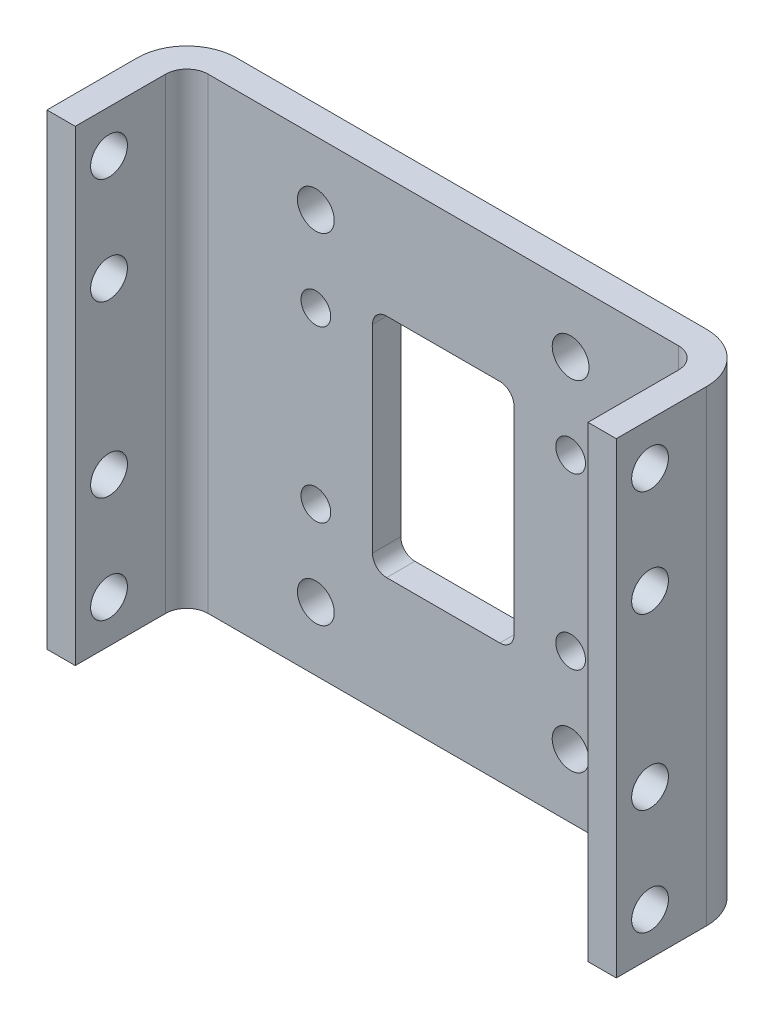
ISO-10303-21;
HEADER;
FILE_DESCRIPTION(('STEP AP214'),'2;1');
FILE_NAME('part.step','',(''),(''),'','','');
FILE_SCHEMA(('AUTOMOTIVE_DESIGN { 1 0 10303 214 1 1 1 1 }'));
ENDSEC;
DATA;
#1=APPLICATION_CONTEXT('core data for automotive mechanical design processes');
#2=APPLICATION_PROTOCOL_DEFINITION('international standard','automotive_design',2000,#1);
#3=PRODUCT_CONTEXT('',#1,'mechanical');
#4=PRODUCT('Part','Part','',(#3));
#5=PRODUCT_RELATED_PRODUCT_CATEGORY('part','',(#4));
#6=PRODUCT_DEFINITION_FORMATION('','',#4);
#7=PRODUCT_DEFINITION_CONTEXT('part definition',#1,'design');
#8=PRODUCT_DEFINITION('design','',#6,#7);
#9=PRODUCT_DEFINITION_SHAPE('','',#8);
#10=(LENGTH_UNIT() NAMED_UNIT(*) SI_UNIT(.MILLI.,.METRE.));
#11=(NAMED_UNIT(*) PLANE_ANGLE_UNIT() SI_UNIT($,.RADIAN.));
#12=(NAMED_UNIT(*) SI_UNIT($,.STERADIAN.) SOLID_ANGLE_UNIT());
#13=UNCERTAINTY_MEASURE_WITH_UNIT(LENGTH_MEASURE(1.E-05),#10,'distance_accuracy_value','');
#14=(GEOMETRIC_REPRESENTATION_CONTEXT(3) GLOBAL_UNCERTAINTY_ASSIGNED_CONTEXT((#13)) GLOBAL_UNIT_ASSIGNED_CONTEXT((#10,
#11,#12)) REPRESENTATION_CONTEXT('',''));
#15=CARTESIAN_POINT('',(0.,0.,0.));
#16=DIRECTION('',(0.,0.,1.));
#17=DIRECTION('',(1.,0.,0.));
#18=AXIS2_PLACEMENT_3D('',#15,#16,#17);
#19=CARTESIAN_POINT('',(-8.,14.,-10.));
#20=DIRECTION('',(0.,0.,-1.));
#21=DIRECTION('',(-1.,0.,0.));
#22=AXIS2_PLACEMENT_3D('',#19,#20,#21);
#23=CYLINDRICAL_SURFACE('',#22,2.);
#24=CARTESIAN_POINT('',(-8.,14.,-4.));
#25=DIRECTION('',(0.,0.,1.));
#26=DIRECTION('',(1.,0.,0.));
#27=AXIS2_PLACEMENT_3D('',#24,#25,#26);
#28=CIRCLE('',#27,2.);
#29=CARTESIAN_POINT('',(-8.,16.,-4.));
#30=VERTEX_POINT('',#29);
#31=CARTESIAN_POINT('',(-10.,14.,-4.));
#32=VERTEX_POINT('',#31);
#33=EDGE_CURVE('E357',#30,#32,#28,.T.);
#34=ORIENTED_EDGE('',*,*,#33,.F.);
#35=DIRECTION('',(0.,0.,-1.));
#36=VECTOR('',#35,1.);
#37=CARTESIAN_POINT('',(-8.,16.,-4.));
#38=LINE('',#37,#36);
#39=CARTESIAN_POINT('',(-8.,16.,0.));
#40=VERTEX_POINT('',#39);
#41=EDGE_CURVE('E11',#40,#30,#38,.T.);
#42=ORIENTED_EDGE('',*,*,#41,.F.);
#43=CARTESIAN_POINT('',(-8.,14.,0.));
#44=DIRECTION('',(0.,0.,-1.));
#45=DIRECTION('',(1.,0.,0.));
#46=AXIS2_PLACEMENT_3D('',#43,#44,#45);
#47=CIRCLE('',#46,2.);
#48=CARTESIAN_POINT('',(-10.,14.,0.));
#49=VERTEX_POINT('',#48);
#50=EDGE_CURVE('E334',#49,#40,#47,.T.);
#51=ORIENTED_EDGE('',*,*,#50,.F.);
#52=DIRECTION('',(0.,0.,1.));
#53=VECTOR('',#52,1.);
#54=CARTESIAN_POINT('',(-10.,14.,0.));
#55=LINE('',#54,#53);
#56=EDGE_CURVE('E493',#32,#49,#55,.T.);
#57=ORIENTED_EDGE('',*,*,#56,.F.);
#58=EDGE_LOOP('',(#34,#42,#51,#57));
#59=FACE_BOUND('',#58,.T.);
#60=ADVANCED_FACE('F17',(#59),#23,.F.);
#61=CARTESIAN_POINT('',(8.,-14.,-10.));
#62=DIRECTION('',(0.,0.,-1.));
#63=DIRECTION('',(-1.,0.,0.));
#64=AXIS2_PLACEMENT_3D('',#61,#62,#63);
#65=CYLINDRICAL_SURFACE('',#64,2.);
#66=CARTESIAN_POINT('',(8.,-14.,-4.));
#67=DIRECTION('',(0.,0.,1.));
#68=DIRECTION('',(1.,0.,0.));
#69=AXIS2_PLACEMENT_3D('',#66,#67,#68);
#70=CIRCLE('',#69,2.);
#71=CARTESIAN_POINT('',(8.,-16.,-4.));
#72=VERTEX_POINT('',#71);
#73=CARTESIAN_POINT('',(10.,-14.,-4.));
#74=VERTEX_POINT('',#73);
#75=EDGE_CURVE('E288',#72,#74,#70,.T.);
#76=ORIENTED_EDGE('',*,*,#75,.F.);
#77=DIRECTION('',(0.,0.,-1.));
#78=VECTOR('',#77,1.);
#79=CARTESIAN_POINT('',(8.,-16.,-4.));
#80=LINE('',#79,#78);
#81=CARTESIAN_POINT('',(8.,-16.,0.));
#82=VERTEX_POINT('',#81);
#83=EDGE_CURVE('E431',#82,#72,#80,.T.);
#84=ORIENTED_EDGE('',*,*,#83,.F.);
#85=CARTESIAN_POINT('',(8.,-14.,0.));
#86=DIRECTION('',(0.,0.,-1.));
#87=DIRECTION('',(1.,0.,0.));
#88=AXIS2_PLACEMENT_3D('',#85,#86,#87);
#89=CIRCLE('',#88,2.);
#90=CARTESIAN_POINT('',(10.,-14.,0.));
#91=VERTEX_POINT('',#90);
#92=EDGE_CURVE('E397',#91,#82,#89,.T.);
#93=ORIENTED_EDGE('',*,*,#92,.F.);
#94=DIRECTION('',(0.,0.,1.));
#95=VECTOR('',#94,1.);
#96=CARTESIAN_POINT('',(10.,-14.,0.));
#97=LINE('',#96,#95);
#98=EDGE_CURVE('E486',#74,#91,#97,.T.);
#99=ORIENTED_EDGE('',*,*,#98,.F.);
#100=EDGE_LOOP('',(#76,#84,#93,#99));
#101=FACE_BOUND('',#100,.T.);
#102=ADVANCED_FACE('F526',(#101),#65,.F.);
#103=CARTESIAN_POINT('',(8.,14.,-10.));
#104=DIRECTION('',(0.,0.,-1.));
#105=DIRECTION('',(-1.,0.,0.));
#106=AXIS2_PLACEMENT_3D('',#103,#104,#105);
#107=CYLINDRICAL_SURFACE('',#106,2.);
#108=CARTESIAN_POINT('',(8.,14.,-4.));
#109=DIRECTION('',(0.,0.,1.));
#110=DIRECTION('',(1.,0.,0.));
#111=AXIS2_PLACEMENT_3D('',#108,#109,#110);
#112=CIRCLE('',#111,2.);
#113=CARTESIAN_POINT('',(10.,14.,-4.));
#114=VERTEX_POINT('',#113);
#115=CARTESIAN_POINT('',(8.,16.,-4.));
#116=VERTEX_POINT('',#115);
#117=EDGE_CURVE('E358',#114,#116,#112,.T.);
#118=ORIENTED_EDGE('',*,*,#117,.F.);
#119=DIRECTION('',(0.,0.,-1.));
#120=VECTOR('',#119,1.);
#121=CARTESIAN_POINT('',(10.,14.,-4.));
#122=LINE('',#121,#120);
#123=CARTESIAN_POINT('',(10.,14.,0.));
#124=VERTEX_POINT('',#123);
#125=EDGE_CURVE('E483',#124,#114,#122,.T.);
#126=ORIENTED_EDGE('',*,*,#125,.F.);
#127=CARTESIAN_POINT('',(8.,14.,0.));
#128=DIRECTION('',(0.,0.,-1.));
#129=DIRECTION('',(1.,0.,0.));
#130=AXIS2_PLACEMENT_3D('',#127,#128,#129);
#131=CIRCLE('',#130,2.);
#132=CARTESIAN_POINT('',(8.,16.,0.));
#133=VERTEX_POINT('',#132);
#134=EDGE_CURVE('E329',#133,#124,#131,.T.);
#135=ORIENTED_EDGE('',*,*,#134,.F.);
#136=DIRECTION('',(0.,0.,1.));
#137=VECTOR('',#136,1.);
#138=CARTESIAN_POINT('',(8.,16.,0.));
#139=LINE('',#138,#137);
#140=EDGE_CURVE('E26',#116,#133,#139,.T.);
#141=ORIENTED_EDGE('',*,*,#140,.F.);
#142=EDGE_LOOP('',(#118,#126,#135,#141));
#143=FACE_BOUND('',#142,.T.);
#144=ADVANCED_FACE('F19',(#143),#107,.F.);
#145=CARTESIAN_POINT('',(-8.,-14.,-10.));
#146=DIRECTION('',(0.,0.,-1.));
#147=DIRECTION('',(-1.,0.,0.));
#148=AXIS2_PLACEMENT_3D('',#145,#146,#147);
#149=CYLINDRICAL_SURFACE('',#148,2.);
#150=CARTESIAN_POINT('',(-8.,-14.,-4.));
#151=DIRECTION('',(0.,0.,1.));
#152=DIRECTION('',(1.,0.,0.));
#153=AXIS2_PLACEMENT_3D('',#150,#151,#152);
#154=CIRCLE('',#153,2.);
#155=CARTESIAN_POINT('',(-10.,-14.,-4.));
#156=VERTEX_POINT('',#155);
#157=CARTESIAN_POINT('',(-8.,-16.,-4.));
#158=VERTEX_POINT('',#157);
#159=EDGE_CURVE('E263',#156,#158,#154,.T.);
#160=ORIENTED_EDGE('',*,*,#159,.F.);
#161=DIRECTION('',(0.,0.,-1.));
#162=VECTOR('',#161,1.);
#163=CARTESIAN_POINT('',(-10.,-14.,-4.));
#164=LINE('',#163,#162);
#165=CARTESIAN_POINT('',(-10.,-14.,0.));
#166=VERTEX_POINT('',#165);
#167=EDGE_CURVE('E434',#166,#156,#164,.T.);
#168=ORIENTED_EDGE('',*,*,#167,.F.);
#169=CARTESIAN_POINT('',(-8.,-14.,0.));
#170=DIRECTION('',(0.,0.,-1.));
#171=DIRECTION('',(1.,0.,0.));
#172=AXIS2_PLACEMENT_3D('',#169,#170,#171);
#173=CIRCLE('',#172,2.);
#174=CARTESIAN_POINT('',(-8.,-16.,0.));
#175=VERTEX_POINT('',#174);
#176=EDGE_CURVE('E410',#175,#166,#173,.T.);
#177=ORIENTED_EDGE('',*,*,#176,.F.);
#178=DIRECTION('',(0.,0.,1.));
#179=VECTOR('',#178,1.);
#180=CARTESIAN_POINT('',(-8.,-16.,0.));
#181=LINE('',#180,#179);
#182=EDGE_CURVE('E435',#158,#175,#181,.T.);
#183=ORIENTED_EDGE('',*,*,#182,.F.);
#184=EDGE_LOOP('',(#160,#168,#177,#183));
#185=FACE_BOUND('',#184,.T.);
#186=ADVANCED_FACE('F533',(#185),#149,.F.);
#187=CARTESIAN_POINT('',(-10.,16.,-10.));
#188=DIRECTION('',(0.,1.,0.));
#189=DIRECTION('',(1.,0.,0.));
#190=AXIS2_PLACEMENT_3D('',#187,#188,#189);
#191=PLANE('',#190);
#192=DIRECTION('',(-1.,0.,0.));
#193=VECTOR('',#192,1.);
#194=CARTESIAN_POINT('',(0.,16.,-4.));
#195=LINE('',#194,#193);
#196=EDGE_CURVE('E353',#116,#30,#195,.T.);
#197=ORIENTED_EDGE('',*,*,#196,.F.);
#198=ORIENTED_EDGE('',*,*,#140,.T.);
#199=DIRECTION('',(-1.,0.,0.));
#200=VECTOR('',#199,1.);
#201=CARTESIAN_POINT('',(-10.,16.,0.));
#202=LINE('',#201,#200);
#203=EDGE_CURVE('E333',#133,#40,#202,.T.);
#204=ORIENTED_EDGE('',*,*,#203,.T.);
#205=ORIENTED_EDGE('',*,*,#41,.T.);
#206=EDGE_LOOP('',(#197,#198,#204,#205));
#207=FACE_BOUND('',#206,.T.);
#208=ADVANCED_FACE('F501',(#207),#191,.F.);
#209=CARTESIAN_POINT('',(-10.,16.,-10.));
#210=DIRECTION('',(-1.,0.,0.));
#211=DIRECTION('',(0.,0.,1.));
#212=AXIS2_PLACEMENT_3D('',#209,#210,#211);
#213=PLANE('',#212);
#214=DIRECTION('',(0.,-1.,0.));
#215=VECTOR('',#214,1.);
#216=CARTESIAN_POINT('',(-10.,16.,0.));
#217=LINE('',#216,#215);
#218=EDGE_CURVE('E338',#49,#166,#217,.T.);
#219=ORIENTED_EDGE('',*,*,#218,.T.);
#220=ORIENTED_EDGE('',*,*,#167,.T.);
#221=DIRECTION('',(0.,-1.,0.));
#222=VECTOR('',#221,1.);
#223=CARTESIAN_POINT('',(-10.,0.,-4.));
#224=LINE('',#223,#222);
#225=EDGE_CURVE('E259',#32,#156,#224,.T.);
#226=ORIENTED_EDGE('',*,*,#225,.F.);
#227=ORIENTED_EDGE('',*,*,#56,.T.);
#228=EDGE_LOOP('',(#219,#220,#226,#227));
#229=FACE_BOUND('',#228,.T.);
#230=ADVANCED_FACE('F784',(#229),#213,.F.);
#231=CARTESIAN_POINT('',(-10.,-16.,-10.));
#232=DIRECTION('',(0.,-1.,0.));
#233=DIRECTION('',(0.,0.,-1.));
#234=AXIS2_PLACEMENT_3D('',#231,#232,#233);
#235=PLANE('',#234);
#236=DIRECTION('',(1.,0.,0.));
#237=VECTOR('',#236,1.);
#238=CARTESIAN_POINT('',(0.,-16.,-4.));
#239=LINE('',#238,#237);
#240=EDGE_CURVE('E293',#158,#72,#239,.T.);
#241=ORIENTED_EDGE('',*,*,#240,.F.);
#242=ORIENTED_EDGE('',*,*,#182,.T.);
#243=DIRECTION('',(1.,0.,0.));
#244=VECTOR('',#243,1.);
#245=CARTESIAN_POINT('',(-10.,-16.,0.));
#246=LINE('',#245,#244);
#247=EDGE_CURVE('E406',#175,#82,#246,.T.);
#248=ORIENTED_EDGE('',*,*,#247,.T.);
#249=ORIENTED_EDGE('',*,*,#83,.T.);
#250=EDGE_LOOP('',(#241,#242,#248,#249));
#251=FACE_BOUND('',#250,.T.);
#252=ADVANCED_FACE('F529',(#251),#235,.F.);
#253=CARTESIAN_POINT('',(10.,16.,-10.));
#254=DIRECTION('',(1.,0.,0.));
#255=DIRECTION('',(0.,1.,0.));
#256=AXIS2_PLACEMENT_3D('',#253,#254,#255);
#257=PLANE('',#256);
#258=DIRECTION('',(0.,1.,0.));
#259=VECTOR('',#258,1.);
#260=CARTESIAN_POINT('',(10.,16.,0.));
#261=LINE('',#260,#259);
#262=EDGE_CURVE('E393',#91,#124,#261,.T.);
#263=ORIENTED_EDGE('',*,*,#262,.T.);
#264=ORIENTED_EDGE('',*,*,#125,.T.);
#265=DIRECTION('',(0.,1.,0.));
#266=VECTOR('',#265,1.);
#267=CARTESIAN_POINT('',(10.,0.,-4.));
#268=LINE('',#267,#266);
#269=EDGE_CURVE('E292',#74,#114,#268,.T.);
#270=ORIENTED_EDGE('',*,*,#269,.F.);
#271=ORIENTED_EDGE('',*,*,#98,.T.);
#272=EDGE_LOOP('',(#263,#264,#270,#271));
#273=FACE_BOUND('',#272,.T.);
#274=ADVANCED_FACE('F522',(#273),#257,.F.);
#275=CARTESIAN_POINT('',(36.225,0.,-38.0789816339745));
#276=DIRECTION('',(-1.,0.,0.));
#277=DIRECTION('',(0.,0.,1.));
#278=AXIS2_PLACEMENT_3D('',#275,#276,#277);
#279=PLANE('',#278);
#280=CARTESIAN_POINT('',(36.225,-27.,10.9999999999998));
#281=DIRECTION('',(-1.,0.,0.));
#282=DIRECTION('',(0.,0.,1.));
#283=AXIS2_PLACEMENT_3D('',#280,#281,#282);
#284=CIRCLE('',#283,2.6);
#285=CARTESIAN_POINT('',(36.225,-27.,13.5999999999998));
#286=VERTEX_POINT('',#285);
#287=EDGE_CURVE('E315',#286,#286,#284,.T.);
#288=ORIENTED_EDGE('',*,*,#287,.F.);
#289=EDGE_LOOP('',(#288));
#290=FACE_BOUND('',#289,.T.);
#291=CARTESIAN_POINT('',(36.225,-12.,10.9999999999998));
#292=DIRECTION('',(-1.,0.,0.));
#293=DIRECTION('',(0.,0.,1.));
#294=AXIS2_PLACEMENT_3D('',#291,#292,#293);
#295=CIRCLE('',#294,2.6);
#296=CARTESIAN_POINT('',(36.225,-12.,13.5999999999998));
#297=VERTEX_POINT('',#296);
#298=EDGE_CURVE('E316',#297,#297,#295,.T.);
#299=ORIENTED_EDGE('',*,*,#298,.F.);
#300=EDGE_LOOP('',(#299));
#301=FACE_BOUND('',#300,.T.);
#302=CARTESIAN_POINT('',(36.225,12.,10.9999999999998));
#303=DIRECTION('',(-1.,0.,0.));
#304=DIRECTION('',(0.,0.,1.));
#305=AXIS2_PLACEMENT_3D('',#302,#303,#304);
#306=CIRCLE('',#305,2.6);
#307=CARTESIAN_POINT('',(36.225,12.,13.5999999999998));
#308=VERTEX_POINT('',#307);
#309=EDGE_CURVE('E265',#308,#308,#306,.T.);
#310=ORIENTED_EDGE('',*,*,#309,.F.);
#311=EDGE_LOOP('',(#310));
#312=FACE_BOUND('',#311,.T.);
#313=CARTESIAN_POINT('',(36.225,27.,10.9999999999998));
#314=DIRECTION('',(-1.,0.,0.));
#315=DIRECTION('',(0.,0.,1.));
#316=AXIS2_PLACEMENT_3D('',#313,#314,#315);
#317=CIRCLE('',#316,2.6);
#318=CARTESIAN_POINT('',(36.225,27.,13.5999999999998));
#319=VERTEX_POINT('',#318);
#320=EDGE_CURVE('E343',#319,#319,#317,.T.);
#321=ORIENTED_EDGE('',*,*,#320,.F.);
#322=EDGE_LOOP('',(#321));
#323=FACE_BOUND('',#322,.T.);
#324=DIRECTION('',(0.,1.,0.));
#325=VECTOR('',#324,1.);
#326=CARTESIAN_POINT('',(36.225,0.,3.00000000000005));
#327=LINE('',#326,#325);
#328=CARTESIAN_POINT('',(36.225,-33.,3.));
#329=VERTEX_POINT('',#328);
#330=CARTESIAN_POINT('',(36.225,33.,3.));
#331=VERTEX_POINT('',#330);
#332=EDGE_CURVE('E457',#329,#331,#327,.T.);
#333=ORIENTED_EDGE('',*,*,#332,.F.);
#334=DIRECTION('',(0.,0.,1.));
#335=VECTOR('',#334,1.);
#336=CARTESIAN_POINT('',(36.225,-33.,-91.9289816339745));
#337=LINE('',#336,#335);
#338=CARTESIAN_POINT('',(36.225,-33.,15.7710183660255));
#339=VERTEX_POINT('',#338);
#340=EDGE_CURVE('E480',#329,#339,#337,.T.);
#341=ORIENTED_EDGE('',*,*,#340,.T.);
#342=DIRECTION('',(0.,1.,0.));
#343=VECTOR('',#342,1.);
#344=CARTESIAN_POINT('',(36.225,33.,15.7710183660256));
#345=LINE('',#344,#343);
#346=CARTESIAN_POINT('',(36.225,33.,15.7710183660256));
#347=VERTEX_POINT('',#346);
#348=EDGE_CURVE('E461',#339,#347,#345,.T.);
#349=ORIENTED_EDGE('',*,*,#348,.T.);
#350=DIRECTION('',(0.,0.,-1.));
#351=VECTOR('',#350,1.);
#352=CARTESIAN_POINT('',(36.225,33.,-91.9289816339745));
#353=LINE('',#352,#351);
#354=EDGE_CURVE('E477',#347,#331,#353,.T.);
#355=ORIENTED_EDGE('',*,*,#354,.T.);
#356=EDGE_LOOP('',(#333,#341,#349,#355));
#357=FACE_BOUND('',#356,.T.);
#358=ADVANCED_FACE('F621',(#290,#301,#312,#323,#357),#279,.T.);
#359=CARTESIAN_POINT('',(40.225,0.,-38.0789816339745));
#360=DIRECTION('',(-1.,0.,0.));
#361=DIRECTION('',(0.,0.,1.));
#362=AXIS2_PLACEMENT_3D('',#359,#360,#361);
#363=PLANE('',#362);
#364=CARTESIAN_POINT('',(40.225,-27.,10.9999999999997));
#365=DIRECTION('',(-1.,0.,0.));
#366=DIRECTION('',(0.,0.,1.));
#367=AXIS2_PLACEMENT_3D('',#364,#365,#366);
#368=CIRCLE('',#367,2.6);
#369=CARTESIAN_POINT('',(40.225,-27.,13.5999999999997));
#370=VERTEX_POINT('',#369);
#371=EDGE_CURVE('E311',#370,#370,#368,.T.);
#372=ORIENTED_EDGE('',*,*,#371,.T.);
#373=EDGE_LOOP('',(#372));
#374=FACE_BOUND('',#373,.T.);
#375=CARTESIAN_POINT('',(40.225,-12.,10.9999999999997));
#376=DIRECTION('',(-1.,0.,0.));
#377=DIRECTION('',(0.,0.,1.));
#378=AXIS2_PLACEMENT_3D('',#375,#376,#377);
#379=CIRCLE('',#378,2.6);
#380=CARTESIAN_POINT('',(40.225,-12.,13.5999999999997));
#381=VERTEX_POINT('',#380);
#382=EDGE_CURVE('E269',#381,#381,#379,.T.);
#383=ORIENTED_EDGE('',*,*,#382,.T.);
#384=EDGE_LOOP('',(#383));
#385=FACE_BOUND('',#384,.T.);
#386=CARTESIAN_POINT('',(40.225,12.,10.9999999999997));
#387=DIRECTION('',(-1.,0.,0.));
#388=DIRECTION('',(0.,0.,1.));
#389=AXIS2_PLACEMENT_3D('',#386,#387,#388);
#390=CIRCLE('',#389,2.6);
#391=CARTESIAN_POINT('',(40.225,12.,13.5999999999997));
#392=VERTEX_POINT('',#391);
#393=EDGE_CURVE('E270',#392,#392,#390,.T.);
#394=ORIENTED_EDGE('',*,*,#393,.T.);
#395=EDGE_LOOP('',(#394));
#396=FACE_BOUND('',#395,.T.);
#397=CARTESIAN_POINT('',(40.225,27.,10.9999999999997));
#398=DIRECTION('',(-1.,0.,0.));
#399=DIRECTION('',(0.,0.,1.));
#400=AXIS2_PLACEMENT_3D('',#397,#398,#399);
#401=CIRCLE('',#400,2.6);
#402=CARTESIAN_POINT('',(40.225,27.,13.5999999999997));
#403=VERTEX_POINT('',#402);
#404=EDGE_CURVE('E339',#403,#403,#401,.T.);
#405=ORIENTED_EDGE('',*,*,#404,.T.);
#406=EDGE_LOOP('',(#405));
#407=FACE_BOUND('',#406,.T.);
#408=DIRECTION('',(0.,0.,1.));
#409=VECTOR('',#408,1.);
#410=CARTESIAN_POINT('',(40.225,-33.,-91.9289816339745));
#411=LINE('',#410,#409);
#412=CARTESIAN_POINT('',(40.225,-33.,3.));
#413=VERTEX_POINT('',#412);
#414=CARTESIAN_POINT('',(40.225,-33.,15.7710183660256));
#415=VERTEX_POINT('',#414);
#416=EDGE_CURVE('E50',#413,#415,#411,.T.);
#417=ORIENTED_EDGE('',*,*,#416,.F.);
#418=DIRECTION('',(0.,1.,0.));
#419=VECTOR('',#418,1.);
#420=CARTESIAN_POINT('',(40.225,0.,3.00000000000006));
#421=LINE('',#420,#419);
#422=CARTESIAN_POINT('',(40.225,33.,3.));
#423=VERTEX_POINT('',#422);
#424=EDGE_CURVE('E454',#413,#423,#421,.T.);
#425=ORIENTED_EDGE('',*,*,#424,.T.);
#426=DIRECTION('',(0.,0.,-1.));
#427=VECTOR('',#426,1.);
#428=CARTESIAN_POINT('',(40.225,33.,-91.9289816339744));
#429=LINE('',#428,#427);
#430=CARTESIAN_POINT('',(40.225,33.,15.7710183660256));
#431=VERTEX_POINT('',#430);
#432=EDGE_CURVE('E39',#431,#423,#429,.T.);
#433=ORIENTED_EDGE('',*,*,#432,.F.);
#434=DIRECTION('',(0.,1.,0.));
#435=VECTOR('',#434,1.);
#436=CARTESIAN_POINT('',(40.225,33.,15.7710183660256));
#437=LINE('',#436,#435);
#438=EDGE_CURVE('E468',#415,#431,#437,.T.);
#439=ORIENTED_EDGE('',*,*,#438,.F.);
#440=EDGE_LOOP('',(#417,#425,#433,#439));
#441=FACE_BOUND('',#440,.T.);
#442=ADVANCED_FACE('F633',(#374,#385,#396,#407,#441),#363,.F.);
#443=CARTESIAN_POINT('',(40.225,33.,15.7710183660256));
#444=DIRECTION('',(0.,0.,1.));
#445=DIRECTION('',(1.,0.,0.));
#446=AXIS2_PLACEMENT_3D('',#443,#444,#445);
#447=PLANE('',#446);
#448=ORIENTED_EDGE('',*,*,#348,.F.);
#449=DIRECTION('',(-1.,0.,0.));
#450=VECTOR('',#449,1.);
#451=CARTESIAN_POINT('',(40.225,-33.,15.7710183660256));
#452=LINE('',#451,#450);
#453=EDGE_CURVE('E465',#415,#339,#452,.T.);
#454=ORIENTED_EDGE('',*,*,#453,.F.);
#455=ORIENTED_EDGE('',*,*,#438,.T.);
#456=DIRECTION('',(-1.,0.,0.));
#457=VECTOR('',#456,1.);
#458=CARTESIAN_POINT('',(40.225,33.,15.7710183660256));
#459=LINE('',#458,#457);
#460=EDGE_CURVE('E472',#431,#347,#459,.T.);
#461=ORIENTED_EDGE('',*,*,#460,.T.);
#462=EDGE_LOOP('',(#448,#454,#455,#461));
#463=FACE_BOUND('',#462,.T.);
#464=ADVANCED_FACE('F617',(#463),#447,.T.);
#465=CARTESIAN_POINT('',(33.225,66.5859221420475,3.));
#466=DIRECTION('',(0.,-1.,0.));
#467=DIRECTION('',(1.,0.,0.));
#468=AXIS2_PLACEMENT_3D('',#465,#466,#467);
#469=CYLINDRICAL_SURFACE('',#468,3.);
#470=DIRECTION('',(0.,1.,0.));
#471=VECTOR('',#470,1.);
#472=CARTESIAN_POINT('',(33.225,0.,0.));
#473=LINE('',#472,#471);
#474=CARTESIAN_POINT('',(33.225,-33.,0.));
#475=VERTEX_POINT('',#474);
#476=CARTESIAN_POINT('',(33.225,33.,0.));
#477=VERTEX_POINT('',#476);
#478=EDGE_CURVE('E380',#475,#477,#473,.T.);
#479=ORIENTED_EDGE('',*,*,#478,.F.);
#480=CARTESIAN_POINT('',(33.225,-33.,3.));
#481=DIRECTION('',(0.,1.,0.));
#482=DIRECTION('',(1.,0.,0.));
#483=AXIS2_PLACEMENT_3D('',#480,#481,#482);
#484=CIRCLE('',#483,3.);
#485=EDGE_CURVE('E279',#329,#475,#484,.T.);
#486=ORIENTED_EDGE('',*,*,#485,.F.);
#487=ORIENTED_EDGE('',*,*,#332,.T.);
#488=CARTESIAN_POINT('',(33.225,33.,3.));
#489=DIRECTION('',(0.,-1.,0.));
#490=DIRECTION('',(1.,0.,0.));
#491=AXIS2_PLACEMENT_3D('',#488,#489,#490);
#492=CIRCLE('',#491,3.);
#493=EDGE_CURVE('E278',#477,#331,#492,.T.);
#494=ORIENTED_EDGE('',*,*,#493,.F.);
#495=EDGE_LOOP('',(#479,#486,#487,#494));
#496=FACE_BOUND('',#495,.T.);
#497=ADVANCED_FACE('F622',(#496),#469,.F.);
#498=CARTESIAN_POINT('',(33.225,66.5859221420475,3.));
#499=DIRECTION('',(0.,-1.,0.));
#500=DIRECTION('',(1.,0.,0.));
#501=AXIS2_PLACEMENT_3D('',#498,#499,#500);
#502=CYLINDRICAL_SURFACE('',#501,7.);
#503=DIRECTION('',(0.,1.,0.));
#504=VECTOR('',#503,1.);
#505=CARTESIAN_POINT('',(33.225,0.,-4.));
#506=LINE('',#505,#504);
#507=CARTESIAN_POINT('',(33.225,-33.,-4.));
#508=VERTEX_POINT('',#507);
#509=CARTESIAN_POINT('',(33.225,33.,-4.));
#510=VERTEX_POINT('',#509);
#511=EDGE_CURVE('E402',#508,#510,#506,.T.);
#512=ORIENTED_EDGE('',*,*,#511,.T.);
#513=CARTESIAN_POINT('',(33.225,33.,3.));
#514=DIRECTION('',(0.,-1.,0.));
#515=DIRECTION('',(0.,0.,1.));
#516=AXIS2_PLACEMENT_3D('',#513,#514,#515);
#517=CIRCLE('',#516,7.);
#518=EDGE_CURVE('E450',#510,#423,#517,.T.);
#519=ORIENTED_EDGE('',*,*,#518,.T.);
#520=ORIENTED_EDGE('',*,*,#424,.F.);
#521=CARTESIAN_POINT('',(33.225,-33.,3.));
#522=DIRECTION('',(0.,1.,0.));
#523=DIRECTION('',(0.,0.,-1.));
#524=AXIS2_PLACEMENT_3D('',#521,#522,#523);
#525=CIRCLE('',#524,7.);
#526=EDGE_CURVE('E275',#413,#508,#525,.T.);
#527=ORIENTED_EDGE('',*,*,#526,.T.);
#528=EDGE_LOOP('',(#512,#519,#520,#527));
#529=FACE_BOUND('',#528,.T.);
#530=ADVANCED_FACE('F624',(#529),#502,.T.);
#531=CARTESIAN_POINT('',(-33.225,-66.5859221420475,3.));
#532=DIRECTION('',(0.,1.,0.));
#533=DIRECTION('',(-1.,0.,0.));
#534=AXIS2_PLACEMENT_3D('',#531,#532,#533);
#535=CYLINDRICAL_SURFACE('',#534,3.);
#536=CARTESIAN_POINT('',(-33.225,33.,3.));
#537=DIRECTION('',(0.,-1.,0.));
#538=DIRECTION('',(-1.,0.,0.));
#539=AXIS2_PLACEMENT_3D('',#536,#537,#538);
#540=CIRCLE('',#539,3.);
#541=CARTESIAN_POINT('',(-36.225,33.,3.));
#542=VERTEX_POINT('',#541);
#543=CARTESIAN_POINT('',(-33.225,33.,0.));
#544=VERTEX_POINT('',#543);
#545=EDGE_CURVE('E439',#542,#544,#540,.T.);
#546=ORIENTED_EDGE('',*,*,#545,.F.);
#547=DIRECTION('',(0.,1.,0.));
#548=VECTOR('',#547,1.);
#549=CARTESIAN_POINT('',(-36.225,0.,3.));
#550=LINE('',#549,#548);
#551=CARTESIAN_POINT('',(-36.225,-33.,3.));
#552=VERTEX_POINT('',#551);
#553=EDGE_CURVE('E217',#552,#542,#550,.T.);
#554=ORIENTED_EDGE('',*,*,#553,.F.);
#555=CARTESIAN_POINT('',(-33.225,-33.,3.));
#556=DIRECTION('',(0.,1.,0.));
#557=DIRECTION('',(-1.,0.,0.));
#558=AXIS2_PLACEMENT_3D('',#555,#556,#557);
#559=CIRCLE('',#558,3.);
#560=CARTESIAN_POINT('',(-33.225,-33.,0.));
#561=VERTEX_POINT('',#560);
#562=EDGE_CURVE('E430',#561,#552,#559,.T.);
#563=ORIENTED_EDGE('',*,*,#562,.F.);
#564=DIRECTION('',(0.,1.,0.));
#565=VECTOR('',#564,1.);
#566=CARTESIAN_POINT('',(-33.225,0.,0.));
#567=LINE('',#566,#565);
#568=EDGE_CURVE('E386',#561,#544,#567,.T.);
#569=ORIENTED_EDGE('',*,*,#568,.T.);
#570=EDGE_LOOP('',(#546,#554,#563,#569));
#571=FACE_BOUND('',#570,.T.);
#572=ADVANCED_FACE('F593',(#571),#535,.F.);
#573=CARTESIAN_POINT('',(-33.225,-66.5859221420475,3.));
#574=DIRECTION('',(0.,1.,0.));
#575=DIRECTION('',(-1.,0.,0.));
#576=AXIS2_PLACEMENT_3D('',#573,#574,#575);
#577=CYLINDRICAL_SURFACE('',#576,7.);
#578=CARTESIAN_POINT('',(-33.225,33.,3.));
#579=DIRECTION('',(0.,-1.,0.));
#580=DIRECTION('',(0.,0.,1.));
#581=AXIS2_PLACEMENT_3D('',#578,#579,#580);
#582=CIRCLE('',#581,7.);
#583=CARTESIAN_POINT('',(-40.225,33.,3.00000000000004));
#584=VERTEX_POINT('',#583);
#585=CARTESIAN_POINT('',(-33.225,33.,-4.));
#586=VERTEX_POINT('',#585);
#587=EDGE_CURVE('E442',#584,#586,#582,.T.);
#588=ORIENTED_EDGE('',*,*,#587,.T.);
#589=DIRECTION('',(0.,1.,0.));
#590=VECTOR('',#589,1.);
#591=CARTESIAN_POINT('',(-33.225,0.,-4.));
#592=LINE('',#591,#590);
#593=CARTESIAN_POINT('',(-33.225,-33.,-4.));
#594=VERTEX_POINT('',#593);
#595=EDGE_CURVE('E264',#594,#586,#592,.T.);
#596=ORIENTED_EDGE('',*,*,#595,.F.);
#597=CARTESIAN_POINT('',(-33.225,-33.,3.));
#598=DIRECTION('',(0.,1.,0.));
#599=DIRECTION('',(0.,0.,-1.));
#600=AXIS2_PLACEMENT_3D('',#597,#598,#599);
#601=CIRCLE('',#600,7.);
#602=CARTESIAN_POINT('',(-40.225,-33.,3.));
#603=VERTEX_POINT('',#602);
#604=EDGE_CURVE('E436',#594,#603,#601,.T.);
#605=ORIENTED_EDGE('',*,*,#604,.T.);
#606=DIRECTION('',(0.,1.,0.));
#607=VECTOR('',#606,1.);
#608=CARTESIAN_POINT('',(-40.225,0.,3.));
#609=LINE('',#608,#607);
#610=EDGE_CURVE('E398',#603,#584,#609,.T.);
#611=ORIENTED_EDGE('',*,*,#610,.T.);
#612=EDGE_LOOP('',(#588,#596,#605,#611));
#613=FACE_BOUND('',#612,.T.);
#614=ADVANCED_FACE('F655',(#613),#577,.T.);
#615=CARTESIAN_POINT('',(0.,0.,-4.));
#616=DIRECTION('',(0.,0.,1.));
#617=DIRECTION('',(1.,0.,0.));
#618=AXIS2_PLACEMENT_3D('',#615,#616,#617);
#619=PLANE('',#618);
#620=CARTESIAN_POINT('',(-18.,24.,-4.));
#621=DIRECTION('',(0.,0.,1.));
#622=DIRECTION('',(1.,0.,0.));
#623=AXIS2_PLACEMENT_3D('',#620,#621,#622);
#624=CIRCLE('',#623,2.6);
#625=CARTESIAN_POINT('',(-15.4,24.,-4.));
#626=VERTEX_POINT('',#625);
#627=EDGE_CURVE('E258',#626,#626,#624,.T.);
#628=ORIENTED_EDGE('',*,*,#627,.T.);
#629=EDGE_LOOP('',(#628));
#630=FACE_BOUND('',#629,.T.);
#631=CARTESIAN_POINT('',(-18.,-12.,-4.));
#632=DIRECTION('',(0.,0.,1.));
#633=DIRECTION('',(1.,0.,0.));
#634=AXIS2_PLACEMENT_3D('',#631,#632,#633);
#635=CIRCLE('',#634,2.1);
#636=CARTESIAN_POINT('',(-15.9,-12.,-4.));
#637=VERTEX_POINT('',#636);
#638=EDGE_CURVE('E250',#637,#637,#635,.T.);
#639=ORIENTED_EDGE('',*,*,#638,.T.);
#640=EDGE_LOOP('',(#639));
#641=FACE_BOUND('',#640,.T.);
#642=CARTESIAN_POINT('',(18.,-12.,-4.));
#643=DIRECTION('',(0.,0.,1.));
#644=DIRECTION('',(1.,0.,0.));
#645=AXIS2_PLACEMENT_3D('',#642,#643,#644);
#646=CIRCLE('',#645,2.1);
#647=CARTESIAN_POINT('',(20.1,-12.,-4.));
#648=VERTEX_POINT('',#647);
#649=EDGE_CURVE('E245',#648,#648,#646,.T.);
#650=ORIENTED_EDGE('',*,*,#649,.T.);
#651=EDGE_LOOP('',(#650));
#652=FACE_BOUND('',#651,.T.);
#653=CARTESIAN_POINT('',(18.,12.,-4.));
#654=DIRECTION('',(0.,0.,1.));
#655=DIRECTION('',(1.,0.,0.));
#656=AXIS2_PLACEMENT_3D('',#653,#654,#655);
#657=CIRCLE('',#656,2.1);
#658=CARTESIAN_POINT('',(20.1,12.,-4.));
#659=VERTEX_POINT('',#658);
#660=EDGE_CURVE('E566',#659,#659,#657,.T.);
#661=ORIENTED_EDGE('',*,*,#660,.T.);
#662=EDGE_LOOP('',(#661));
#663=FACE_BOUND('',#662,.T.);
#664=CARTESIAN_POINT('',(-18.,12.,-4.));
#665=DIRECTION('',(0.,0.,1.));
#666=DIRECTION('',(1.,0.,0.));
#667=AXIS2_PLACEMENT_3D('',#664,#665,#666);
#668=CIRCLE('',#667,2.1);
#669=CARTESIAN_POINT('',(-15.9,12.,-4.));
#670=VERTEX_POINT('',#669);
#671=EDGE_CURVE('E552',#670,#670,#668,.T.);
#672=ORIENTED_EDGE('',*,*,#671,.T.);
#673=EDGE_LOOP('',(#672));
#674=FACE_BOUND('',#673,.T.);
#675=CARTESIAN_POINT('',(-18.,-24.,-4.));
#676=DIRECTION('',(0.,0.,1.));
#677=DIRECTION('',(1.,0.,0.));
#678=AXIS2_PLACEMENT_3D('',#675,#676,#677);
#679=CIRCLE('',#678,2.6);
#680=CARTESIAN_POINT('',(-15.4,-24.,-4.));
#681=VERTEX_POINT('',#680);
#682=EDGE_CURVE('E547',#681,#681,#679,.T.);
#683=ORIENTED_EDGE('',*,*,#682,.T.);
#684=EDGE_LOOP('',(#683));
#685=FACE_BOUND('',#684,.T.);
#686=CARTESIAN_POINT('',(18.,-24.,-4.));
#687=DIRECTION('',(0.,0.,1.));
#688=DIRECTION('',(1.,0.,0.));
#689=AXIS2_PLACEMENT_3D('',#686,#687,#688);
#690=CIRCLE('',#689,2.6);
#691=CARTESIAN_POINT('',(20.6,-24.,-4.));
#692=VERTEX_POINT('',#691);
#693=EDGE_CURVE('E548',#692,#692,#690,.T.);
#694=ORIENTED_EDGE('',*,*,#693,.T.);
#695=EDGE_LOOP('',(#694));
#696=FACE_BOUND('',#695,.T.);
#697=CARTESIAN_POINT('',(18.,24.,-4.));
#698=DIRECTION('',(0.,0.,1.));
#699=DIRECTION('',(1.,0.,0.));
#700=AXIS2_PLACEMENT_3D('',#697,#698,#699);
#701=CIRCLE('',#700,2.6);
#702=CARTESIAN_POINT('',(20.6,24.,-4.));
#703=VERTEX_POINT('',#702);
#704=EDGE_CURVE('E610',#703,#703,#701,.T.);
#705=ORIENTED_EDGE('',*,*,#704,.T.);
#706=EDGE_LOOP('',(#705));
#707=FACE_BOUND('',#706,.T.);
#708=ORIENTED_EDGE('',*,*,#225,.T.);
#709=ORIENTED_EDGE('',*,*,#159,.T.);
#710=ORIENTED_EDGE('',*,*,#240,.T.);
#711=ORIENTED_EDGE('',*,*,#75,.T.);
#712=ORIENTED_EDGE('',*,*,#269,.T.);
#713=ORIENTED_EDGE('',*,*,#117,.T.);
#714=ORIENTED_EDGE('',*,*,#196,.T.);
#715=ORIENTED_EDGE('',*,*,#33,.T.);
#716=EDGE_LOOP('',(#708,#709,#710,#711,#712,#713,#714,#715));
#717=FACE_BOUND('',#716,.T.);
#718=ORIENTED_EDGE('',*,*,#511,.F.);
#719=DIRECTION('',(1.,0.,0.));
#720=VECTOR('',#719,1.);
#721=CARTESIAN_POINT('',(-53.85,-33.,-4.));
#722=LINE('',#721,#720);
#723=EDGE_CURVE('E371',#594,#508,#722,.T.);
#724=ORIENTED_EDGE('',*,*,#723,.F.);
#725=ORIENTED_EDGE('',*,*,#595,.T.);
#726=DIRECTION('',(-1.,0.,0.));
#727=VECTOR('',#726,1.);
#728=CARTESIAN_POINT('',(-53.85,33.,-4.));
#729=LINE('',#728,#727);
#730=EDGE_CURVE('E324',#510,#586,#729,.T.);
#731=ORIENTED_EDGE('',*,*,#730,.F.);
#732=EDGE_LOOP('',(#718,#724,#725,#731));
#733=FACE_BOUND('',#732,.T.);
#734=ADVANCED_FACE('F517',(#630,#641,#652,#663,#674,#685,#696,#707,#717,#733),#619,.F.);
#735=CARTESIAN_POINT('',(-40.225,0.,-38.0789816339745));
#736=DIRECTION('',(1.,0.,0.));
#737=DIRECTION('',(0.,0.,-1.));
#738=AXIS2_PLACEMENT_3D('',#735,#736,#737);
#739=PLANE('',#738);
#740=CARTESIAN_POINT('',(-40.225,-27.,11.));
#741=DIRECTION('',(-1.,0.,0.));
#742=DIRECTION('',(0.,0.,-1.));
#743=AXIS2_PLACEMENT_3D('',#740,#741,#742);
#744=CIRCLE('',#743,2.6);
#745=CARTESIAN_POINT('',(-40.225,-27.,8.4));
#746=VERTEX_POINT('',#745);
#747=EDGE_CURVE('E323',#746,#746,#744,.T.);
#748=ORIENTED_EDGE('',*,*,#747,.F.);
#749=EDGE_LOOP('',(#748));
#750=FACE_BOUND('',#749,.T.);
#751=CARTESIAN_POINT('',(-40.225,-12.,11.));
#752=DIRECTION('',(-1.,0.,0.));
#753=DIRECTION('',(0.,0.,-1.));
#754=AXIS2_PLACEMENT_3D('',#751,#752,#753);
#755=CIRCLE('',#754,2.6);
#756=CARTESIAN_POINT('',(-40.225,-12.,8.4));
#757=VERTEX_POINT('',#756);
#758=EDGE_CURVE('E306',#757,#757,#755,.T.);
#759=ORIENTED_EDGE('',*,*,#758,.F.);
#760=EDGE_LOOP('',(#759));
#761=FACE_BOUND('',#760,.T.);
#762=CARTESIAN_POINT('',(-40.225,12.,11.));
#763=DIRECTION('',(-1.,0.,0.));
#764=DIRECTION('',(0.,0.,1.));
#765=AXIS2_PLACEMENT_3D('',#762,#763,#764);
#766=CIRCLE('',#765,2.6);
#767=CARTESIAN_POINT('',(-40.225,12.,13.6));
#768=VERTEX_POINT('',#767);
#769=EDGE_CURVE('E301',#768,#768,#766,.T.);
#770=ORIENTED_EDGE('',*,*,#769,.F.);
#771=EDGE_LOOP('',(#770));
#772=FACE_BOUND('',#771,.T.);
#773=CARTESIAN_POINT('',(-40.225,27.,11.));
#774=DIRECTION('',(-1.,0.,0.));
#775=DIRECTION('',(0.,0.,1.));
#776=AXIS2_PLACEMENT_3D('',#773,#774,#775);
#777=CIRCLE('',#776,2.6);
#778=CARTESIAN_POINT('',(-40.225,27.,13.6));
#779=VERTEX_POINT('',#778);
#780=EDGE_CURVE('E287',#779,#779,#777,.T.);
#781=ORIENTED_EDGE('',*,*,#780,.F.);
#782=EDGE_LOOP('',(#781));
#783=FACE_BOUND('',#782,.T.);
#784=ORIENTED_EDGE('',*,*,#610,.F.);
#785=DIRECTION('',(0.,0.,-1.));
#786=VECTOR('',#785,1.);
#787=CARTESIAN_POINT('',(-40.225,-33.,15.7710183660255));
#788=LINE('',#787,#786);
#789=CARTESIAN_POINT('',(-40.225,-33.,15.7710183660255));
#790=VERTEX_POINT('',#789);
#791=EDGE_CURVE('E328',#790,#603,#788,.T.);
#792=ORIENTED_EDGE('',*,*,#791,.F.);
#793=DIRECTION('',(0.,-1.,0.));
#794=VECTOR('',#793,1.);
#795=CARTESIAN_POINT('',(-40.225,33.,15.7710183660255));
#796=LINE('',#795,#794);
#797=CARTESIAN_POINT('',(-40.225,33.,15.7710183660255));
#798=VERTEX_POINT('',#797);
#799=EDGE_CURVE('E216',#798,#790,#796,.T.);
#800=ORIENTED_EDGE('',*,*,#799,.F.);
#801=DIRECTION('',(0.,0.,1.));
#802=VECTOR('',#801,1.);
#803=CARTESIAN_POINT('',(-40.225,33.,15.7710183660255));
#804=LINE('',#803,#802);
#805=EDGE_CURVE('E225',#584,#798,#804,.T.);
#806=ORIENTED_EDGE('',*,*,#805,.F.);
#807=EDGE_LOOP('',(#784,#792,#800,#806));
#808=FACE_BOUND('',#807,.T.);
#809=ADVANCED_FACE('F578',(#750,#761,#772,#783,#808),#739,.F.);
#810=CARTESIAN_POINT('',(-40.225,33.,15.7710183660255));
#811=DIRECTION('',(0.,0.,1.));
#812=DIRECTION('',(1.,0.,0.));
#813=AXIS2_PLACEMENT_3D('',#810,#811,#812);
#814=PLANE('',#813);
#815=DIRECTION('',(0.,-1.,0.));
#816=VECTOR('',#815,1.);
#817=CARTESIAN_POINT('',(-36.225,33.,15.7710183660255));
#818=LINE('',#817,#816);
#819=CARTESIAN_POINT('',(-36.225,33.,15.7710183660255));
#820=VERTEX_POINT('',#819);
#821=CARTESIAN_POINT('',(-36.225,-33.,15.7710183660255));
#822=VERTEX_POINT('',#821);
#823=EDGE_CURVE('E204',#820,#822,#818,.T.);
#824=ORIENTED_EDGE('',*,*,#823,.F.);
#825=DIRECTION('',(1.,0.,0.));
#826=VECTOR('',#825,1.);
#827=CARTESIAN_POINT('',(-40.225,33.,15.7710183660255));
#828=LINE('',#827,#826);
#829=EDGE_CURVE('E207',#798,#820,#828,.T.);
#830=ORIENTED_EDGE('',*,*,#829,.F.);
#831=ORIENTED_EDGE('',*,*,#799,.T.);
#832=DIRECTION('',(1.,0.,0.));
#833=VECTOR('',#832,1.);
#834=CARTESIAN_POINT('',(-40.225,-33.,15.7710183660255));
#835=LINE('',#834,#833);
#836=EDGE_CURVE('E210',#790,#822,#835,.T.);
#837=ORIENTED_EDGE('',*,*,#836,.T.);
#838=EDGE_LOOP('',(#824,#830,#831,#837));
#839=FACE_BOUND('',#838,.T.);
#840=ADVANCED_FACE('F206',(#839),#814,.T.);
#841=CARTESIAN_POINT('',(-36.225,0.,-38.0789816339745));
#842=DIRECTION('',(1.,0.,0.));
#843=DIRECTION('',(0.,0.,-1.));
#844=AXIS2_PLACEMENT_3D('',#841,#842,#843);
#845=PLANE('',#844);
#846=CARTESIAN_POINT('',(-36.225,-27.,11.));
#847=DIRECTION('',(1.,0.,0.));
#848=DIRECTION('',(0.,0.,-1.));
#849=AXIS2_PLACEMENT_3D('',#846,#847,#848);
#850=CIRCLE('',#849,2.6);
#851=CARTESIAN_POINT('',(-36.225,-27.,8.4));
#852=VERTEX_POINT('',#851);
#853=EDGE_CURVE('E310',#852,#852,#850,.T.);
#854=ORIENTED_EDGE('',*,*,#853,.F.);
#855=EDGE_LOOP('',(#854));
#856=FACE_BOUND('',#855,.T.);
#857=CARTESIAN_POINT('',(-36.225,-12.,11.));
#858=DIRECTION('',(1.,0.,0.));
#859=DIRECTION('',(0.,0.,-1.));
#860=AXIS2_PLACEMENT_3D('',#857,#858,#859);
#861=CIRCLE('',#860,2.6);
#862=CARTESIAN_POINT('',(-36.225,-12.,8.4));
#863=VERTEX_POINT('',#862);
#864=EDGE_CURVE('E302',#863,#863,#861,.T.);
#865=ORIENTED_EDGE('',*,*,#864,.F.);
#866=EDGE_LOOP('',(#865));
#867=FACE_BOUND('',#866,.T.);
#868=CARTESIAN_POINT('',(-36.225,12.,11.));
#869=DIRECTION('',(1.,0.,0.));
#870=DIRECTION('',(0.,0.,-1.));
#871=AXIS2_PLACEMENT_3D('',#868,#869,#870);
#872=CIRCLE('',#871,2.6);
#873=CARTESIAN_POINT('',(-36.225,12.,8.4));
#874=VERTEX_POINT('',#873);
#875=EDGE_CURVE('E297',#874,#874,#872,.T.);
#876=ORIENTED_EDGE('',*,*,#875,.F.);
#877=EDGE_LOOP('',(#876));
#878=FACE_BOUND('',#877,.T.);
#879=CARTESIAN_POINT('',(-36.225,27.,11.));
#880=DIRECTION('',(1.,0.,0.));
#881=DIRECTION('',(0.,0.,-1.));
#882=AXIS2_PLACEMENT_3D('',#879,#880,#881);
#883=CIRCLE('',#882,2.6);
#884=CARTESIAN_POINT('',(-36.225,27.,8.4));
#885=VERTEX_POINT('',#884);
#886=EDGE_CURVE('E283',#885,#885,#883,.T.);
#887=ORIENTED_EDGE('',*,*,#886,.F.);
#888=EDGE_LOOP('',(#887));
#889=FACE_BOUND('',#888,.T.);
#890=DIRECTION('',(0.,0.,-1.));
#891=VECTOR('',#890,1.);
#892=CARTESIAN_POINT('',(-36.225,-33.,15.7710183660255));
#893=LINE('',#892,#891);
#894=EDGE_CURVE('E239',#822,#552,#893,.T.);
#895=ORIENTED_EDGE('',*,*,#894,.T.);
#896=ORIENTED_EDGE('',*,*,#553,.T.);
#897=DIRECTION('',(0.,0.,1.));
#898=VECTOR('',#897,1.);
#899=CARTESIAN_POINT('',(-36.225,33.,15.7710183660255));
#900=LINE('',#899,#898);
#901=EDGE_CURVE('E223',#542,#820,#900,.T.);
#902=ORIENTED_EDGE('',*,*,#901,.T.);
#903=ORIENTED_EDGE('',*,*,#823,.T.);
#904=EDGE_LOOP('',(#895,#896,#902,#903));
#905=FACE_BOUND('',#904,.T.);
#906=ADVANCED_FACE('F229',(#856,#867,#878,#889,#905),#845,.T.);
#907=CARTESIAN_POINT('',(-53.85,33.,-4.));
#908=DIRECTION('',(0.,1.,0.));
#909=DIRECTION('',(1.,0.,0.));
#910=AXIS2_PLACEMENT_3D('',#907,#908,#909);
#911=PLANE('',#910);
#912=DIRECTION('',(-1.,0.,0.));
#913=VECTOR('',#912,1.);
#914=CARTESIAN_POINT('',(-53.85,33.,0.));
#915=LINE('',#914,#913);
#916=EDGE_CURVE('E382',#477,#544,#915,.T.);
#917=ORIENTED_EDGE('',*,*,#916,.F.);
#918=ORIENTED_EDGE('',*,*,#493,.T.);
#919=ORIENTED_EDGE('',*,*,#354,.F.);
#920=ORIENTED_EDGE('',*,*,#460,.F.);
#921=ORIENTED_EDGE('',*,*,#432,.T.);
#922=ORIENTED_EDGE('',*,*,#518,.F.);
#923=ORIENTED_EDGE('',*,*,#730,.T.);
#924=ORIENTED_EDGE('',*,*,#587,.F.);
#925=ORIENTED_EDGE('',*,*,#805,.T.);
#926=ORIENTED_EDGE('',*,*,#829,.T.);
#927=ORIENTED_EDGE('',*,*,#901,.F.);
#928=ORIENTED_EDGE('',*,*,#545,.T.);
#929=EDGE_LOOP('',(#917,#918,#919,#920,#921,#922,#923,#924,#925,#926,#927,#928));
#930=FACE_BOUND('',#929,.T.);
#931=ADVANCED_FACE('F222',(#930),#911,.T.);
#932=CARTESIAN_POINT('',(0.,0.,0.));
#933=DIRECTION('',(0.,0.,1.));
#934=DIRECTION('',(1.,0.,0.));
#935=AXIS2_PLACEMENT_3D('',#932,#933,#934);
#936=PLANE('',#935);
#937=CARTESIAN_POINT('',(-18.,24.,0.));
#938=DIRECTION('',(0.,0.,1.));
#939=DIRECTION('',(1.,0.,0.));
#940=AXIS2_PLACEMENT_3D('',#937,#938,#939);
#941=CIRCLE('',#940,2.6);
#942=CARTESIAN_POINT('',(-15.4,24.,0.));
#943=VERTEX_POINT('',#942);
#944=EDGE_CURVE('E274',#943,#943,#941,.T.);
#945=ORIENTED_EDGE('',*,*,#944,.F.);
#946=EDGE_LOOP('',(#945));
#947=FACE_BOUND('',#946,.T.);
#948=CARTESIAN_POINT('',(-18.,-12.,0.));
#949=DIRECTION('',(0.,0.,1.));
#950=DIRECTION('',(-1.,0.,0.));
#951=AXIS2_PLACEMENT_3D('',#948,#949,#950);
#952=CIRCLE('',#951,2.1);
#953=CARTESIAN_POINT('',(-20.1,-12.,0.));
#954=VERTEX_POINT('',#953);
#955=EDGE_CURVE('E254',#954,#954,#952,.T.);
#956=ORIENTED_EDGE('',*,*,#955,.F.);
#957=EDGE_LOOP('',(#956));
#958=FACE_BOUND('',#957,.T.);
#959=CARTESIAN_POINT('',(18.,-12.,0.));
#960=DIRECTION('',(0.,0.,1.));
#961=DIRECTION('',(1.,0.,0.));
#962=AXIS2_PLACEMENT_3D('',#959,#960,#961);
#963=CIRCLE('',#962,2.1);
#964=CARTESIAN_POINT('',(20.1,-12.,0.));
#965=VERTEX_POINT('',#964);
#966=EDGE_CURVE('E249',#965,#965,#963,.T.);
#967=ORIENTED_EDGE('',*,*,#966,.F.);
#968=EDGE_LOOP('',(#967));
#969=FACE_BOUND('',#968,.T.);
#970=CARTESIAN_POINT('',(18.,12.,0.));
#971=DIRECTION('',(0.,0.,1.));
#972=DIRECTION('',(-1.,0.,0.));
#973=AXIS2_PLACEMENT_3D('',#970,#971,#972);
#974=CIRCLE('',#973,2.1);
#975=CARTESIAN_POINT('',(15.9,12.,0.));
#976=VERTEX_POINT('',#975);
#977=EDGE_CURVE('E243',#976,#976,#974,.T.);
#978=ORIENTED_EDGE('',*,*,#977,.F.);
#979=EDGE_LOOP('',(#978));
#980=FACE_BOUND('',#979,.T.);
#981=CARTESIAN_POINT('',(-18.,12.,0.));
#982=DIRECTION('',(0.,0.,1.));
#983=DIRECTION('',(1.,0.,0.));
#984=AXIS2_PLACEMENT_3D('',#981,#982,#983);
#985=CIRCLE('',#984,2.1);
#986=CARTESIAN_POINT('',(-15.9,12.,0.));
#987=VERTEX_POINT('',#986);
#988=EDGE_CURVE('E556',#987,#987,#985,.T.);
#989=ORIENTED_EDGE('',*,*,#988,.F.);
#990=EDGE_LOOP('',(#989));
#991=FACE_BOUND('',#990,.T.);
#992=CARTESIAN_POINT('',(-18.,-24.,0.));
#993=DIRECTION('',(0.,0.,1.));
#994=DIRECTION('',(-1.,0.,0.));
#995=AXIS2_PLACEMENT_3D('',#992,#993,#994);
#996=CIRCLE('',#995,2.6);
#997=CARTESIAN_POINT('',(-20.6,-24.,0.));
#998=VERTEX_POINT('',#997);
#999=EDGE_CURVE('E557',#998,#998,#996,.T.);
#1000=ORIENTED_EDGE('',*,*,#999,.F.);
#1001=EDGE_LOOP('',(#1000));
#1002=FACE_BOUND('',#1001,.T.);
#1003=CARTESIAN_POINT('',(18.,-24.,0.));
#1004=DIRECTION('',(0.,0.,1.));
#1005=DIRECTION('',(1.,0.,0.));
#1006=AXIS2_PLACEMENT_3D('',#1003,#1004,#1005);
#1007=CIRCLE('',#1006,2.6);
#1008=CARTESIAN_POINT('',(20.6,-24.,0.));
#1009=VERTEX_POINT('',#1008);
#1010=EDGE_CURVE('E543',#1009,#1009,#1007,.T.);
#1011=ORIENTED_EDGE('',*,*,#1010,.F.);
#1012=EDGE_LOOP('',(#1011));
#1013=FACE_BOUND('',#1012,.T.);
#1014=CARTESIAN_POINT('',(18.,24.,0.));
#1015=DIRECTION('',(0.,0.,1.));
#1016=DIRECTION('',(-1.,0.,0.));
#1017=AXIS2_PLACEMENT_3D('',#1014,#1015,#1016);
#1018=CIRCLE('',#1017,2.6);
#1019=CARTESIAN_POINT('',(15.4,24.,0.));
#1020=VERTEX_POINT('',#1019);
#1021=EDGE_CURVE('E607',#1020,#1020,#1018,.T.);
#1022=ORIENTED_EDGE('',*,*,#1021,.F.);
#1023=EDGE_LOOP('',(#1022));
#1024=FACE_BOUND('',#1023,.T.);
#1025=ORIENTED_EDGE('',*,*,#262,.F.);
#1026=ORIENTED_EDGE('',*,*,#92,.T.);
#1027=ORIENTED_EDGE('',*,*,#247,.F.);
#1028=ORIENTED_EDGE('',*,*,#176,.T.);
#1029=ORIENTED_EDGE('',*,*,#218,.F.);
#1030=ORIENTED_EDGE('',*,*,#50,.T.);
#1031=ORIENTED_EDGE('',*,*,#203,.F.);
#1032=ORIENTED_EDGE('',*,*,#134,.T.);
#1033=EDGE_LOOP('',(#1025,#1026,#1027,#1028,#1029,#1030,#1031,#1032));
#1034=FACE_BOUND('',#1033,.T.);
#1035=DIRECTION('',(1.,0.,0.));
#1036=VECTOR('',#1035,1.);
#1037=CARTESIAN_POINT('',(-53.85,-33.,0.));
#1038=LINE('',#1037,#1036);
#1039=EDGE_CURVE('E375',#561,#475,#1038,.T.);
#1040=ORIENTED_EDGE('',*,*,#1039,.T.);
#1041=ORIENTED_EDGE('',*,*,#478,.T.);
#1042=ORIENTED_EDGE('',*,*,#916,.T.);
#1043=ORIENTED_EDGE('',*,*,#568,.F.);
#1044=EDGE_LOOP('',(#1040,#1041,#1042,#1043));
#1045=FACE_BOUND('',#1044,.T.);
#1046=ADVANCED_FACE('F507',(#947,#958,#969,#980,#991,#1002,#1013,#1024,#1034,#1045),#936,.T.);
#1047=CARTESIAN_POINT('',(-53.85,-33.,-4.));
#1048=DIRECTION('',(0.,-1.,0.));
#1049=DIRECTION('',(0.,0.,-1.));
#1050=AXIS2_PLACEMENT_3D('',#1047,#1048,#1049);
#1051=PLANE('',#1050);
#1052=ORIENTED_EDGE('',*,*,#723,.T.);
#1053=ORIENTED_EDGE('',*,*,#526,.F.);
#1054=ORIENTED_EDGE('',*,*,#416,.T.);
#1055=ORIENTED_EDGE('',*,*,#453,.T.);
#1056=ORIENTED_EDGE('',*,*,#340,.F.);
#1057=ORIENTED_EDGE('',*,*,#485,.T.);
#1058=ORIENTED_EDGE('',*,*,#1039,.F.);
#1059=ORIENTED_EDGE('',*,*,#562,.T.);
#1060=ORIENTED_EDGE('',*,*,#894,.F.);
#1061=ORIENTED_EDGE('',*,*,#836,.F.);
#1062=ORIENTED_EDGE('',*,*,#791,.T.);
#1063=ORIENTED_EDGE('',*,*,#604,.F.);
#1064=EDGE_LOOP('',(#1052,#1053,#1054,#1055,#1056,#1057,#1058,#1059,#1060,#1061,#1062,#1063));
#1065=FACE_BOUND('',#1064,.T.);
#1066=ADVANCED_FACE('F588',(#1065),#1051,.T.);
#1067=CARTESIAN_POINT('',(89.775,-27.,10.9999999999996));
#1068=DIRECTION('',(-1.,0.,0.));
#1069=DIRECTION('',(0.,0.,1.));
#1070=AXIS2_PLACEMENT_3D('',#1067,#1068,#1069);
#1071=CYLINDRICAL_SURFACE('',#1070,2.6);
#1072=ORIENTED_EDGE('',*,*,#287,.T.);
#1073=EDGE_LOOP('',(#1072));
#1074=FACE_BOUND('',#1073,.T.);
#1075=ORIENTED_EDGE('',*,*,#371,.F.);
#1076=EDGE_LOOP('',(#1075));
#1077=FACE_BOUND('',#1076,.T.);
#1078=ADVANCED_FACE('F711',(#1074,#1077),#1071,.F.);
#1079=CARTESIAN_POINT('',(89.775,-12.,10.9999999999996));
#1080=DIRECTION('',(-1.,0.,0.));
#1081=DIRECTION('',(0.,0.,1.));
#1082=AXIS2_PLACEMENT_3D('',#1079,#1080,#1081);
#1083=CYLINDRICAL_SURFACE('',#1082,2.6);
#1084=ORIENTED_EDGE('',*,*,#298,.T.);
#1085=EDGE_LOOP('',(#1084));
#1086=FACE_BOUND('',#1085,.T.);
#1087=ORIENTED_EDGE('',*,*,#382,.F.);
#1088=EDGE_LOOP('',(#1087));
#1089=FACE_BOUND('',#1088,.T.);
#1090=ADVANCED_FACE('F714',(#1086,#1089),#1083,.F.);
#1091=CARTESIAN_POINT('',(89.775,12.,10.9999999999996));
#1092=DIRECTION('',(-1.,0.,0.));
#1093=DIRECTION('',(0.,0.,1.));
#1094=AXIS2_PLACEMENT_3D('',#1091,#1092,#1093);
#1095=CYLINDRICAL_SURFACE('',#1094,2.6);
#1096=ORIENTED_EDGE('',*,*,#309,.T.);
#1097=EDGE_LOOP('',(#1096));
#1098=FACE_BOUND('',#1097,.T.);
#1099=ORIENTED_EDGE('',*,*,#393,.F.);
#1100=EDGE_LOOP('',(#1099));
#1101=FACE_BOUND('',#1100,.T.);
#1102=ADVANCED_FACE('F753',(#1098,#1101),#1095,.F.);
#1103=CARTESIAN_POINT('',(89.775,27.,10.9999999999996));
#1104=DIRECTION('',(-1.,0.,0.));
#1105=DIRECTION('',(0.,0.,1.));
#1106=AXIS2_PLACEMENT_3D('',#1103,#1104,#1105);
#1107=CYLINDRICAL_SURFACE('',#1106,2.6);
#1108=ORIENTED_EDGE('',*,*,#320,.T.);
#1109=EDGE_LOOP('',(#1108));
#1110=FACE_BOUND('',#1109,.T.);
#1111=ORIENTED_EDGE('',*,*,#404,.F.);
#1112=EDGE_LOOP('',(#1111));
#1113=FACE_BOUND('',#1112,.T.);
#1114=ADVANCED_FACE('F720',(#1110,#1113),#1107,.F.);
#1115=CARTESIAN_POINT('',(89.775,-27.,10.9999999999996));
#1116=DIRECTION('',(-1.,0.,0.));
#1117=DIRECTION('',(0.,0.,1.));
#1118=AXIS2_PLACEMENT_3D('',#1115,#1116,#1117);
#1119=CYLINDRICAL_SURFACE('',#1118,2.6);
#1120=ORIENTED_EDGE('',*,*,#747,.T.);
#1121=EDGE_LOOP('',(#1120));
#1122=FACE_BOUND('',#1121,.T.);
#1123=ORIENTED_EDGE('',*,*,#853,.T.);
#1124=EDGE_LOOP('',(#1123));
#1125=FACE_BOUND('',#1124,.T.);
#1126=ADVANCED_FACE('F716',(#1122,#1125),#1119,.F.);
#1127=CARTESIAN_POINT('',(89.775,-12.,10.9999999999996));
#1128=DIRECTION('',(-1.,0.,0.));
#1129=DIRECTION('',(0.,0.,1.));
#1130=AXIS2_PLACEMENT_3D('',#1127,#1128,#1129);
#1131=CYLINDRICAL_SURFACE('',#1130,2.6);
#1132=ORIENTED_EDGE('',*,*,#758,.T.);
#1133=EDGE_LOOP('',(#1132));
#1134=FACE_BOUND('',#1133,.T.);
#1135=ORIENTED_EDGE('',*,*,#864,.T.);
#1136=EDGE_LOOP('',(#1135));
#1137=FACE_BOUND('',#1136,.T.);
#1138=ADVANCED_FACE('F719',(#1134,#1137),#1131,.F.);
#1139=CARTESIAN_POINT('',(89.775,12.,10.9999999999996));
#1140=DIRECTION('',(-1.,0.,0.));
#1141=DIRECTION('',(0.,0.,1.));
#1142=AXIS2_PLACEMENT_3D('',#1139,#1140,#1141);
#1143=CYLINDRICAL_SURFACE('',#1142,2.6);
#1144=ORIENTED_EDGE('',*,*,#769,.T.);
#1145=EDGE_LOOP('',(#1144));
#1146=FACE_BOUND('',#1145,.T.);
#1147=ORIENTED_EDGE('',*,*,#875,.T.);
#1148=EDGE_LOOP('',(#1147));
#1149=FACE_BOUND('',#1148,.T.);
#1150=ADVANCED_FACE('F575',(#1146,#1149),#1143,.F.);
#1151=CARTESIAN_POINT('',(89.775,27.,10.9999999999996));
#1152=DIRECTION('',(-1.,0.,0.));
#1153=DIRECTION('',(0.,0.,1.));
#1154=AXIS2_PLACEMENT_3D('',#1151,#1152,#1153);
#1155=CYLINDRICAL_SURFACE('',#1154,2.6);
#1156=ORIENTED_EDGE('',*,*,#780,.T.);
#1157=EDGE_LOOP('',(#1156));
#1158=FACE_BOUND('',#1157,.T.);
#1159=ORIENTED_EDGE('',*,*,#886,.T.);
#1160=EDGE_LOOP('',(#1159));
#1161=FACE_BOUND('',#1160,.T.);
#1162=ADVANCED_FACE('F742',(#1158,#1161),#1155,.F.);
#1163=CARTESIAN_POINT('',(-18.,24.,-130.));
#1164=DIRECTION('',(0.,0.,1.));
#1165=DIRECTION('',(1.,0.,0.));
#1166=AXIS2_PLACEMENT_3D('',#1163,#1164,#1165);
#1167=CYLINDRICAL_SURFACE('',#1166,2.6);
#1168=ORIENTED_EDGE('',*,*,#944,.T.);
#1169=EDGE_LOOP('',(#1168));
#1170=FACE_BOUND('',#1169,.T.);
#1171=ORIENTED_EDGE('',*,*,#627,.F.);
#1172=EDGE_LOOP('',(#1171));
#1173=FACE_BOUND('',#1172,.T.);
#1174=ADVANCED_FACE('F729',(#1170,#1173),#1167,.F.);
#1175=CARTESIAN_POINT('',(-18.,-12.,-130.));
#1176=DIRECTION('',(0.,0.,1.));
#1177=DIRECTION('',(1.,0.,0.));
#1178=AXIS2_PLACEMENT_3D('',#1175,#1176,#1177);
#1179=CYLINDRICAL_SURFACE('',#1178,2.1);
#1180=ORIENTED_EDGE('',*,*,#955,.T.);
#1181=EDGE_LOOP('',(#1180));
#1182=FACE_BOUND('',#1181,.T.);
#1183=ORIENTED_EDGE('',*,*,#638,.F.);
#1184=EDGE_LOOP('',(#1183));
#1185=FACE_BOUND('',#1184,.T.);
#1186=ADVANCED_FACE('F725',(#1182,#1185),#1179,.F.);
#1187=CARTESIAN_POINT('',(18.,-12.,-130.));
#1188=DIRECTION('',(0.,0.,1.));
#1189=DIRECTION('',(1.,0.,0.));
#1190=AXIS2_PLACEMENT_3D('',#1187,#1188,#1189);
#1191=CYLINDRICAL_SURFACE('',#1190,2.1);
#1192=ORIENTED_EDGE('',*,*,#966,.T.);
#1193=EDGE_LOOP('',(#1192));
#1194=FACE_BOUND('',#1193,.T.);
#1195=ORIENTED_EDGE('',*,*,#649,.F.);
#1196=EDGE_LOOP('',(#1195));
#1197=FACE_BOUND('',#1196,.T.);
#1198=ADVANCED_FACE('F728',(#1194,#1197),#1191,.F.);
#1199=CARTESIAN_POINT('',(18.,12.,-130.));
#1200=DIRECTION('',(0.,0.,1.));
#1201=DIRECTION('',(1.,0.,0.));
#1202=AXIS2_PLACEMENT_3D('',#1199,#1200,#1201);
#1203=CYLINDRICAL_SURFACE('',#1202,2.1);
#1204=ORIENTED_EDGE('',*,*,#977,.T.);
#1205=EDGE_LOOP('',(#1204));
#1206=FACE_BOUND('',#1205,.T.);
#1207=ORIENTED_EDGE('',*,*,#660,.F.);
#1208=EDGE_LOOP('',(#1207));
#1209=FACE_BOUND('',#1208,.T.);
#1210=ADVANCED_FACE('F731',(#1206,#1209),#1203,.F.);
#1211=CARTESIAN_POINT('',(-18.,12.,-130.));
#1212=DIRECTION('',(0.,0.,1.));
#1213=DIRECTION('',(1.,0.,0.));
#1214=AXIS2_PLACEMENT_3D('',#1211,#1212,#1213);
#1215=CYLINDRICAL_SURFACE('',#1214,2.1);
#1216=ORIENTED_EDGE('',*,*,#988,.T.);
#1217=EDGE_LOOP('',(#1216));
#1218=FACE_BOUND('',#1217,.T.);
#1219=ORIENTED_EDGE('',*,*,#671,.F.);
#1220=EDGE_LOOP('',(#1219));
#1221=FACE_BOUND('',#1220,.T.);
#1222=ADVANCED_FACE('F688',(#1218,#1221),#1215,.F.);
#1223=CARTESIAN_POINT('',(-18.,-24.,-130.));
#1224=DIRECTION('',(0.,0.,1.));
#1225=DIRECTION('',(1.,0.,0.));
#1226=AXIS2_PLACEMENT_3D('',#1223,#1224,#1225);
#1227=CYLINDRICAL_SURFACE('',#1226,2.6);
#1228=ORIENTED_EDGE('',*,*,#999,.T.);
#1229=EDGE_LOOP('',(#1228));
#1230=FACE_BOUND('',#1229,.T.);
#1231=ORIENTED_EDGE('',*,*,#682,.F.);
#1232=EDGE_LOOP('',(#1231));
#1233=FACE_BOUND('',#1232,.T.);
#1234=ADVANCED_FACE('F705',(#1230,#1233),#1227,.F.);
#1235=CARTESIAN_POINT('',(18.,-24.,-130.));
#1236=DIRECTION('',(0.,0.,1.));
#1237=DIRECTION('',(1.,0.,0.));
#1238=AXIS2_PLACEMENT_3D('',#1235,#1236,#1237);
#1239=CYLINDRICAL_SURFACE('',#1238,2.6);
#1240=ORIENTED_EDGE('',*,*,#1010,.T.);
#1241=EDGE_LOOP('',(#1240));
#1242=FACE_BOUND('',#1241,.T.);
#1243=ORIENTED_EDGE('',*,*,#693,.F.);
#1244=EDGE_LOOP('',(#1243));
#1245=FACE_BOUND('',#1244,.T.);
#1246=ADVANCED_FACE('F700',(#1242,#1245),#1239,.F.);
#1247=CARTESIAN_POINT('',(18.,24.,-130.));
#1248=DIRECTION('',(0.,0.,1.));
#1249=DIRECTION('',(1.,0.,0.));
#1250=AXIS2_PLACEMENT_3D('',#1247,#1248,#1249);
#1251=CYLINDRICAL_SURFACE('',#1250,2.6);
#1252=ORIENTED_EDGE('',*,*,#1021,.T.);
#1253=EDGE_LOOP('',(#1252));
#1254=FACE_BOUND('',#1253,.T.);
#1255=ORIENTED_EDGE('',*,*,#704,.F.);
#1256=EDGE_LOOP('',(#1255));
#1257=FACE_BOUND('',#1256,.T.);
#1258=ADVANCED_FACE('F698',(#1254,#1257),#1251,.F.);
#1259=CLOSED_SHELL('',(#60,#102,#144,#186,#208,#230,#252,#274,#358,#442,#464,#497,#530,#572,
#614,#734,#809,#840,#906,#931,#1046,#1066,#1078,#1090,#1102,#1114,#1126,#1138,#1150,#1162,#1174,
#1186,#1198,#1210,#1222,#1234,#1246,#1258));
#1260=MANIFOLD_SOLID_BREP('B1',#1259);
#1261=ADVANCED_BREP_SHAPE_REPRESENTATION('',(#18,#1260),#14);
#1262=SHAPE_DEFINITION_REPRESENTATION(#9,#1261);
ENDSEC;
END-ISO-10303-21;
